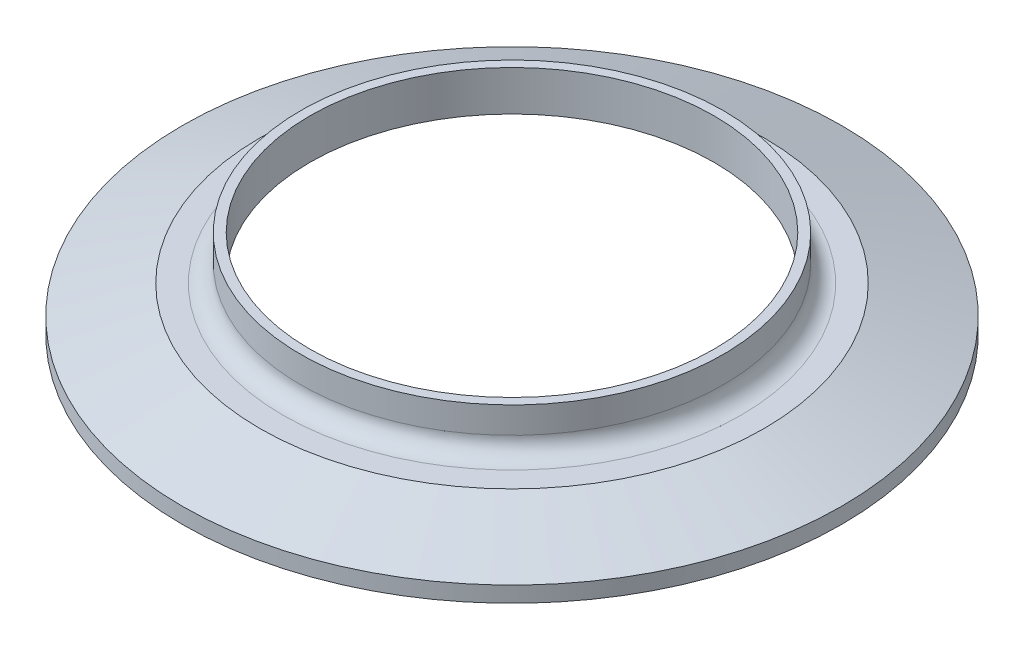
from build123d import *


with BuildPart() as part:
    # Sketch1 → Revolve1 (revolve)
    with BuildSketch(Plane.XY, mode=Mode.PRIVATE) as revolve1_sk:
        with BuildLine():
            Line((-38.1, 15.875), (-38.1, 11.1252))
            ThreePointArc((-38.1, 11.1252), (-39.02993597, 8.88013597), (-41.275, 7.9502))
            Line((-41.275, 7.9502), (-45.434428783, 7.9502))
            Line((-45.434428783, 7.9502), (-59.4614, 2.8448))
            Line((-59.4614, 2.8448), (-59.4614, 0))
            Line((-59.4614, 0), (-56.92485771, 0))
            ThreePointArc((-56.92485771, 0), (-56.416561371, 0.086556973), (-56.070800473, 0.469057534))
            Line((-56.070800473, 0.469057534), (-55.899398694, 0.872854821))
            ThreePointArc((-55.899398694, 0.872854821), (-54.8005, 1.6002), (-53.701601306, 0.872854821))
            Line((-53.701601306, 0.872854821), (-53.534733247, 0.479738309))
            ThreePointArc((-53.534733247, 0.479738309), (-53.244522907, 0.130798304), (-52.809927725, 0))
            Line((-52.809927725, 0), (-48.6918, 0))
            Line((-48.6918, 0), (-36.449, 8.604383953))
            Line((-36.449, 8.604383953), (-36.449, 15.875))
            Line((-36.449, 15.875), (-38.1, 15.875))
        make_face()
    revolve(revolve1_sk.sketch.rotate(Axis((0, 0, 0), (0, 1, 0)), 270), axis=Axis((0, 0, 0), (0, 1, 0)))


solid = part.part
